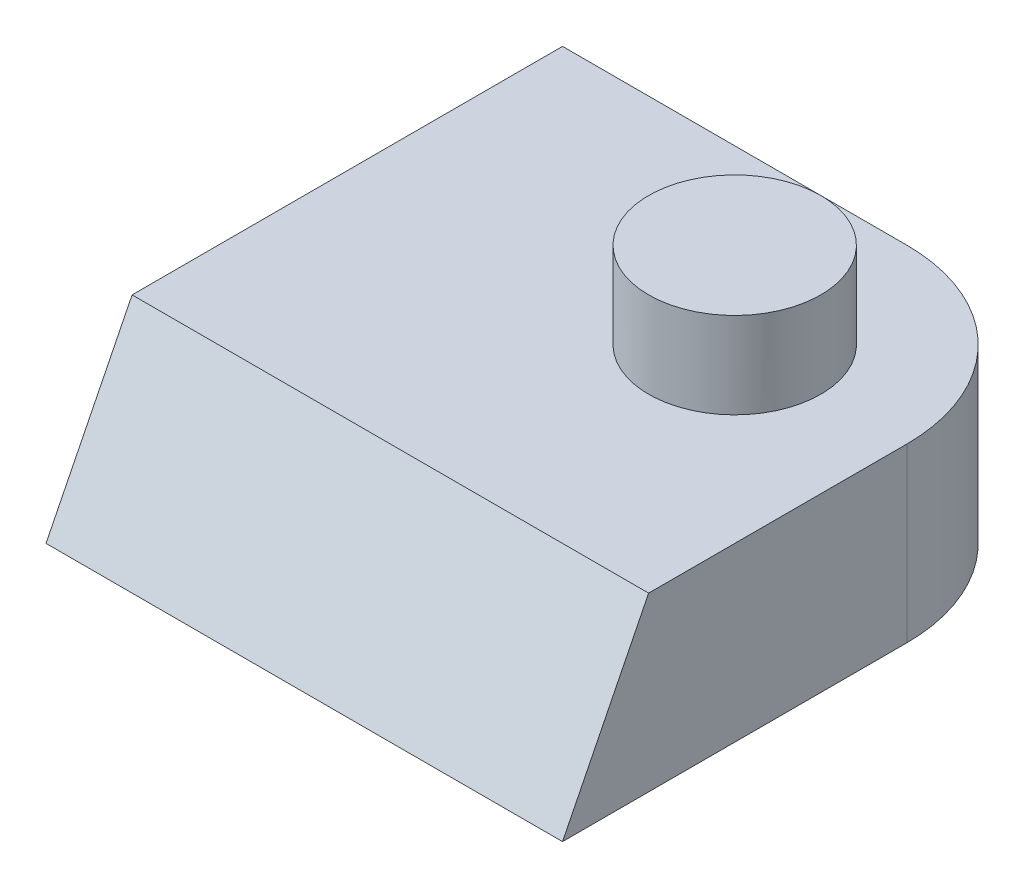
ISO-10303-21;
HEADER;
FILE_DESCRIPTION(('STEP AP214'),'2;1');
FILE_NAME('part.step','',(''),(''),'','','');
FILE_SCHEMA(('AUTOMOTIVE_DESIGN { 1 0 10303 214 1 1 1 1 }'));
ENDSEC;
DATA;
#1=APPLICATION_CONTEXT('core data for automotive mechanical design processes');
#2=APPLICATION_PROTOCOL_DEFINITION('international standard','automotive_design',2000,#1);
#3=PRODUCT_CONTEXT('',#1,'mechanical');
#4=PRODUCT('Part','Part','',(#3));
#5=PRODUCT_RELATED_PRODUCT_CATEGORY('part','',(#4));
#6=PRODUCT_DEFINITION_FORMATION('','',#4);
#7=PRODUCT_DEFINITION_CONTEXT('part definition',#1,'design');
#8=PRODUCT_DEFINITION('design','',#6,#7);
#9=PRODUCT_DEFINITION_SHAPE('','',#8);
#10=(LENGTH_UNIT() NAMED_UNIT(*) SI_UNIT(.MILLI.,.METRE.));
#11=(NAMED_UNIT(*) PLANE_ANGLE_UNIT() SI_UNIT($,.RADIAN.));
#12=(NAMED_UNIT(*) SI_UNIT($,.STERADIAN.) SOLID_ANGLE_UNIT());
#13=UNCERTAINTY_MEASURE_WITH_UNIT(LENGTH_MEASURE(1.E-05),#10,'distance_accuracy_value','');
#14=(GEOMETRIC_REPRESENTATION_CONTEXT(3) GLOBAL_UNCERTAINTY_ASSIGNED_CONTEXT((#13)) GLOBAL_UNIT_ASSIGNED_CONTEXT((#10,
#11,#12)) REPRESENTATION_CONTEXT('',''));
#15=CARTESIAN_POINT('',(0.,0.,0.));
#16=DIRECTION('',(0.,0.,1.));
#17=DIRECTION('',(1.,0.,0.));
#18=AXIS2_PLACEMENT_3D('',#15,#16,#17);
#19=CARTESIAN_POINT('',(-30.,20.,-30.));
#20=DIRECTION('',(0.,-1.,0.));
#21=DIRECTION('',(0.,0.,-1.));
#22=AXIS2_PLACEMENT_3D('',#19,#20,#21);
#23=PLANE('',#22);
#24=DIRECTION('',(0.,0.,-1.));
#25=VECTOR('',#24,1.);
#26=CARTESIAN_POINT('',(30.,20.,30.));
#27=LINE('',#26,#25);
#28=CARTESIAN_POINT('',(30.,20.,20.));
#29=VERTEX_POINT('',#28);
#30=CARTESIAN_POINT('',(30.,20.,-9.99999999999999));
#31=VERTEX_POINT('',#30);
#32=EDGE_CURVE('E102',#29,#31,#27,.T.);
#33=ORIENTED_EDGE('',*,*,#32,.T.);
#34=CARTESIAN_POINT('',(10.,20.,-10.));
#35=DIRECTION('',(0.,-1.,0.));
#36=DIRECTION('',(0.,0.,-1.));
#37=AXIS2_PLACEMENT_3D('',#34,#35,#36);
#38=CIRCLE('',#37,20.);
#39=CARTESIAN_POINT('',(10.,20.,-30.));
#40=VERTEX_POINT('',#39);
#41=EDGE_CURVE('E39',#31,#40,#38,.F.);
#42=ORIENTED_EDGE('',*,*,#41,.T.);
#43=DIRECTION('',(-1.,0.,0.));
#44=VECTOR('',#43,1.);
#45=CARTESIAN_POINT('',(-30.,20.,-30.));
#46=LINE('',#45,#44);
#47=CARTESIAN_POINT('',(-30.,20.,-30.));
#48=VERTEX_POINT('',#47);
#49=EDGE_CURVE('E100',#40,#48,#46,.T.);
#50=ORIENTED_EDGE('',*,*,#49,.T.);
#51=DIRECTION('',(0.,0.,1.));
#52=VECTOR('',#51,1.);
#53=CARTESIAN_POINT('',(-30.,20.,30.));
#54=LINE('',#53,#52);
#55=CARTESIAN_POINT('',(-30.,20.,20.));
#56=VERTEX_POINT('',#55);
#57=EDGE_CURVE('E95',#48,#56,#54,.T.);
#58=ORIENTED_EDGE('',*,*,#57,.T.);
#59=DIRECTION('',(1.,0.,0.));
#60=VECTOR('',#59,1.);
#61=CARTESIAN_POINT('',(-30.,20.,20.));
#62=LINE('',#61,#60);
#63=EDGE_CURVE('E79',#56,#29,#62,.T.);
#64=ORIENTED_EDGE('',*,*,#63,.T.);
#65=EDGE_LOOP('',(#33,#42,#50,#58,#64));
#66=FACE_BOUND('',#65,.T.);
#67=CARTESIAN_POINT('',(10.,20.,-10.));
#68=DIRECTION('',(0.,-1.,0.));
#69=DIRECTION('',(0.,0.,-1.));
#70=AXIS2_PLACEMENT_3D('',#67,#68,#69);
#71=CIRCLE('',#70,10.);
#72=CARTESIAN_POINT('',(10.,20.,-20.));
#73=VERTEX_POINT('',#72);
#74=EDGE_CURVE('E11',#73,#73,#71,.F.);
#75=ORIENTED_EDGE('',*,*,#74,.F.);
#76=EDGE_LOOP('',(#75));
#77=FACE_BOUND('',#76,.T.);
#78=ADVANCED_FACE('F31',(#66,#77),#23,.F.);
#79=CARTESIAN_POINT('',(-30.,20.,30.));
#80=DIRECTION('',(1.,0.,0.));
#81=DIRECTION('',(0.,0.,-1.));
#82=AXIS2_PLACEMENT_3D('',#79,#80,#81);
#83=PLANE('',#82);
#84=DIRECTION('',(0.,0.,1.));
#85=VECTOR('',#84,1.);
#86=CARTESIAN_POINT('',(-30.,0.,30.));
#87=LINE('',#86,#85);
#88=CARTESIAN_POINT('',(-30.,0.,-30.));
#89=VERTEX_POINT('',#88);
#90=CARTESIAN_POINT('',(-30.,0.,30.));
#91=VERTEX_POINT('',#90);
#92=EDGE_CURVE('E88',#89,#91,#87,.T.);
#93=ORIENTED_EDGE('',*,*,#92,.T.);
#94=DIRECTION('',(0.,0.894427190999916,-0.447213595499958));
#95=VECTOR('',#94,1.);
#96=CARTESIAN_POINT('',(-30.,20.,20.));
#97=LINE('',#96,#95);
#98=EDGE_CURVE('E82',#91,#56,#97,.T.);
#99=ORIENTED_EDGE('',*,*,#98,.T.);
#100=ORIENTED_EDGE('',*,*,#57,.F.);
#101=DIRECTION('',(0.,-1.,0.));
#102=VECTOR('',#101,1.);
#103=CARTESIAN_POINT('',(-30.,20.,-30.));
#104=LINE('',#103,#102);
#105=EDGE_CURVE('E111',#48,#89,#104,.T.);
#106=ORIENTED_EDGE('',*,*,#105,.T.);
#107=EDGE_LOOP('',(#93,#99,#100,#106));
#108=FACE_BOUND('',#107,.T.);
#109=ADVANCED_FACE('F93',(#108),#83,.F.);
#110=CARTESIAN_POINT('',(30.,20.,30.));
#111=DIRECTION('',(-1.,0.,0.));
#112=DIRECTION('',(0.,0.,1.));
#113=AXIS2_PLACEMENT_3D('',#110,#111,#112);
#114=PLANE('',#113);
#115=DIRECTION('',(0.,0.,-1.));
#116=VECTOR('',#115,1.);
#117=CARTESIAN_POINT('',(30.,0.,30.));
#118=LINE('',#117,#116);
#119=CARTESIAN_POINT('',(30.,0.,30.));
#120=VERTEX_POINT('',#119);
#121=CARTESIAN_POINT('',(30.,0.,-9.99999999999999));
#122=VERTEX_POINT('',#121);
#123=EDGE_CURVE('E106',#120,#122,#118,.T.);
#124=ORIENTED_EDGE('',*,*,#123,.T.);
#125=DIRECTION('',(0.,-1.,0.));
#126=VECTOR('',#125,1.);
#127=CARTESIAN_POINT('',(30.,20.,-9.99999999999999));
#128=LINE('',#127,#126);
#129=EDGE_CURVE('E46',#122,#31,#128,.F.);
#130=ORIENTED_EDGE('',*,*,#129,.T.);
#131=ORIENTED_EDGE('',*,*,#32,.F.);
#132=DIRECTION('',(0.,0.894427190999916,-0.447213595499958));
#133=VECTOR('',#132,1.);
#134=CARTESIAN_POINT('',(30.,20.,20.));
#135=LINE('',#134,#133);
#136=EDGE_CURVE('E85',#120,#29,#135,.T.);
#137=ORIENTED_EDGE('',*,*,#136,.F.);
#138=EDGE_LOOP('',(#124,#130,#131,#137));
#139=FACE_BOUND('',#138,.T.);
#140=ADVANCED_FACE('F142',(#139),#114,.F.);
#141=CARTESIAN_POINT('',(-30.,20.,-30.));
#142=DIRECTION('',(0.,0.,1.));
#143=DIRECTION('',(1.,0.,0.));
#144=AXIS2_PLACEMENT_3D('',#141,#142,#143);
#145=PLANE('',#144);
#146=ORIENTED_EDGE('',*,*,#49,.F.);
#147=DIRECTION('',(0.,-1.,0.));
#148=VECTOR('',#147,1.);
#149=CARTESIAN_POINT('',(10.,20.,-30.));
#150=LINE('',#149,#148);
#151=CARTESIAN_POINT('',(10.,0.,-30.));
#152=VERTEX_POINT('',#151);
#153=EDGE_CURVE('E117',#40,#152,#150,.T.);
#154=ORIENTED_EDGE('',*,*,#153,.T.);
#155=DIRECTION('',(-1.,0.,0.));
#156=VECTOR('',#155,1.);
#157=CARTESIAN_POINT('',(-30.,0.,-30.));
#158=LINE('',#157,#156);
#159=EDGE_CURVE('E103',#152,#89,#158,.T.);
#160=ORIENTED_EDGE('',*,*,#159,.T.);
#161=ORIENTED_EDGE('',*,*,#105,.F.);
#162=EDGE_LOOP('',(#146,#154,#160,#161));
#163=FACE_BOUND('',#162,.T.);
#164=ADVANCED_FACE('F125',(#163),#145,.F.);
#165=CARTESIAN_POINT('',(-30.,0.,-30.));
#166=DIRECTION('',(0.,-1.,0.));
#167=DIRECTION('',(0.,0.,-1.));
#168=AXIS2_PLACEMENT_3D('',#165,#166,#167);
#169=PLANE('',#168);
#170=ORIENTED_EDGE('',*,*,#159,.F.);
#171=CARTESIAN_POINT('',(10.,0.,-10.));
#172=DIRECTION('',(0.,-1.,0.));
#173=DIRECTION('',(0.,0.,-1.));
#174=AXIS2_PLACEMENT_3D('',#171,#172,#173);
#175=CIRCLE('',#174,20.);
#176=EDGE_CURVE('E54',#152,#122,#175,.T.);
#177=ORIENTED_EDGE('',*,*,#176,.T.);
#178=ORIENTED_EDGE('',*,*,#123,.F.);
#179=DIRECTION('',(1.,0.,0.));
#180=VECTOR('',#179,1.);
#181=CARTESIAN_POINT('',(-30.,0.,30.));
#182=LINE('',#181,#180);
#183=EDGE_CURVE('E113',#91,#120,#182,.T.);
#184=ORIENTED_EDGE('',*,*,#183,.F.);
#185=ORIENTED_EDGE('',*,*,#92,.F.);
#186=EDGE_LOOP('',(#170,#177,#178,#184,#185));
#187=FACE_BOUND('',#186,.T.);
#188=ADVANCED_FACE('F135',(#187),#169,.T.);
#189=CARTESIAN_POINT('',(-30.,20.,20.));
#190=DIRECTION('',(0.,-0.447213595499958,-0.894427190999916));
#191=DIRECTION('',(0.,0.894427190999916,-0.447213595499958));
#192=AXIS2_PLACEMENT_3D('',#189,#190,#191);
#193=PLANE('',#192);
#194=ORIENTED_EDGE('',*,*,#136,.T.);
#195=ORIENTED_EDGE('',*,*,#63,.F.);
#196=ORIENTED_EDGE('',*,*,#98,.F.);
#197=ORIENTED_EDGE('',*,*,#183,.T.);
#198=EDGE_LOOP('',(#194,#195,#196,#197));
#199=FACE_BOUND('',#198,.T.);
#200=ADVANCED_FACE('F81',(#199),#193,.F.);
#201=CARTESIAN_POINT('',(10.,20.,-10.));
#202=DIRECTION('',(0.,-1.,0.));
#203=DIRECTION('',(0.,0.,-1.));
#204=AXIS2_PLACEMENT_3D('',#201,#202,#203);
#205=CYLINDRICAL_SURFACE('',#204,20.);
#206=ORIENTED_EDGE('',*,*,#41,.F.);
#207=ORIENTED_EDGE('',*,*,#129,.F.);
#208=ORIENTED_EDGE('',*,*,#176,.F.);
#209=ORIENTED_EDGE('',*,*,#153,.F.);
#210=EDGE_LOOP('',(#206,#207,#208,#209));
#211=FACE_BOUND('',#210,.T.);
#212=ADVANCED_FACE('F33',(#211),#205,.T.);
#213=CARTESIAN_POINT('',(10.,30.,-10.));
#214=DIRECTION('',(0.,-1.,0.));
#215=DIRECTION('',(0.,0.,-1.));
#216=AXIS2_PLACEMENT_3D('',#213,#214,#215);
#217=CYLINDRICAL_SURFACE('',#216,10.);
#218=CARTESIAN_POINT('',(10.,30.,-10.));
#219=DIRECTION('',(0.,1.,0.));
#220=DIRECTION('',(0.,0.,1.));
#221=AXIS2_PLACEMENT_3D('',#218,#219,#220);
#222=CIRCLE('',#221,10.);
#223=CARTESIAN_POINT('',(10.,30.,0.));
#224=VERTEX_POINT('',#223);
#225=EDGE_CURVE('E151',#224,#224,#222,.T.);
#226=ORIENTED_EDGE('',*,*,#225,.F.);
#227=EDGE_LOOP('',(#226));
#228=FACE_BOUND('',#227,.T.);
#229=ORIENTED_EDGE('',*,*,#74,.T.);
#230=EDGE_LOOP('',(#229));
#231=FACE_BOUND('',#230,.T.);
#232=ADVANCED_FACE('F127',(#228,#231),#217,.T.);
#233=CARTESIAN_POINT('',(10.,30.,-10.));
#234=DIRECTION('',(0.,1.,0.));
#235=DIRECTION('',(0.,0.,1.));
#236=AXIS2_PLACEMENT_3D('',#233,#234,#235);
#237=PLANE('',#236);
#238=ORIENTED_EDGE('',*,*,#225,.T.);
#239=EDGE_LOOP('',(#238));
#240=FACE_BOUND('',#239,.T.);
#241=ADVANCED_FACE('F132',(#240),#237,.T.);
#242=CLOSED_SHELL('',(#78,#109,#140,#164,#188,#200,#212,#232,#241));
#243=MANIFOLD_SOLID_BREP('B2',#242);
#244=ADVANCED_BREP_SHAPE_REPRESENTATION('',(#18,#243),#14);
#245=SHAPE_DEFINITION_REPRESENTATION(#9,#244);
ENDSEC;
END-ISO-10303-21;
